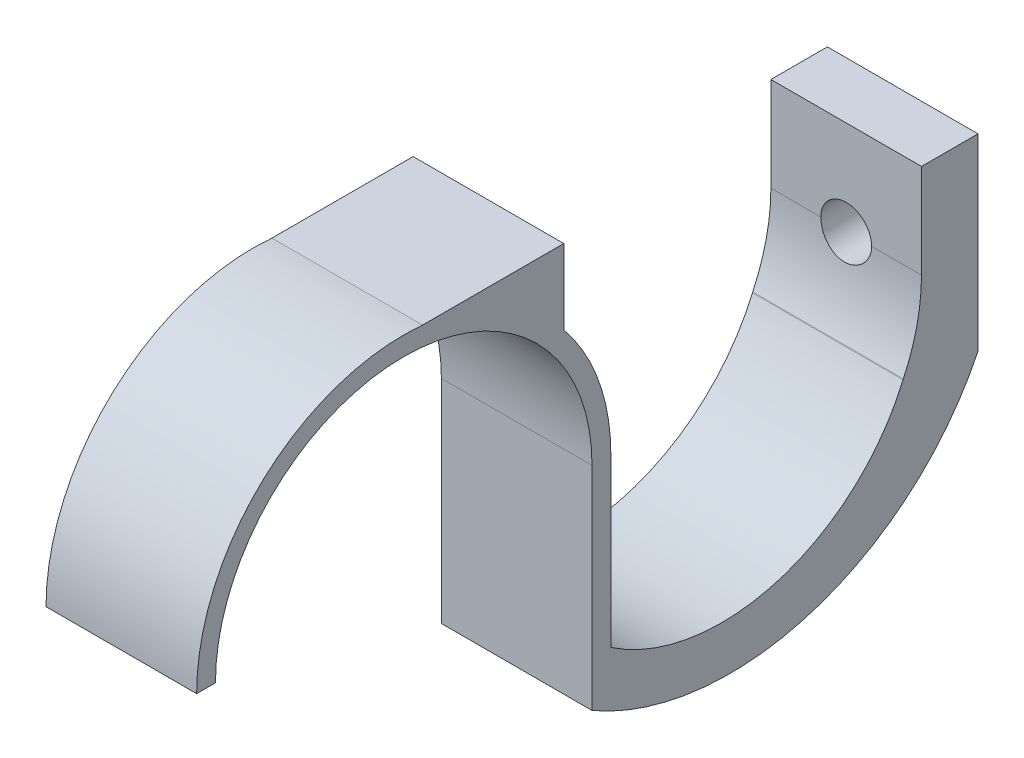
ISO-10303-21;
HEADER;
FILE_DESCRIPTION(('STEP AP214'),'2;1');
FILE_NAME('part.step','',(''),(''),'','','');
FILE_SCHEMA(('AUTOMOTIVE_DESIGN { 1 0 10303 214 1 1 1 1 }'));
ENDSEC;
DATA;
#1=APPLICATION_CONTEXT('core data for automotive mechanical design processes');
#2=APPLICATION_PROTOCOL_DEFINITION('international standard','automotive_design',2000,#1);
#3=PRODUCT_CONTEXT('',#1,'mechanical');
#4=PRODUCT('Part','Part','',(#3));
#5=PRODUCT_RELATED_PRODUCT_CATEGORY('part','',(#4));
#6=PRODUCT_DEFINITION_FORMATION('','',#4);
#7=PRODUCT_DEFINITION_CONTEXT('part definition',#1,'design');
#8=PRODUCT_DEFINITION('design','',#6,#7);
#9=PRODUCT_DEFINITION_SHAPE('','',#8);
#10=(LENGTH_UNIT() NAMED_UNIT(*) SI_UNIT(.MILLI.,.METRE.));
#11=(NAMED_UNIT(*) PLANE_ANGLE_UNIT() SI_UNIT($,.RADIAN.));
#12=(NAMED_UNIT(*) SI_UNIT($,.STERADIAN.) SOLID_ANGLE_UNIT());
#13=UNCERTAINTY_MEASURE_WITH_UNIT(LENGTH_MEASURE(1.E-05),#10,'distance_accuracy_value','');
#14=(GEOMETRIC_REPRESENTATION_CONTEXT(3) GLOBAL_UNCERTAINTY_ASSIGNED_CONTEXT((#13)) GLOBAL_UNIT_ASSIGNED_CONTEXT((#10,
#11,#12)) REPRESENTATION_CONTEXT('',''));
#15=CARTESIAN_POINT('',(0.,0.,0.));
#16=DIRECTION('',(0.,0.,1.));
#17=DIRECTION('',(1.,0.,0.));
#18=AXIS2_PLACEMENT_3D('',#15,#16,#17);
#19=CARTESIAN_POINT('',(10.16,0.,0.));
#20=DIRECTION('',(1.,0.,0.));
#21=DIRECTION('',(0.,0.,-1.));
#22=AXIS2_PLACEMENT_3D('',#19,#20,#21);
#23=PLANE('',#22);
#24=DIRECTION('',(0.,1.,0.));
#25=VECTOR('',#24,1.);
#26=CARTESIAN_POINT('',(10.16,6.35,-19.05));
#27=LINE('',#26,#25);
#28=CARTESIAN_POINT('',(10.16,0.,-19.05));
#29=VERTEX_POINT('',#28);
#30=CARTESIAN_POINT('',(10.16,6.35,-19.05));
#31=VERTEX_POINT('',#30);
#32=EDGE_CURVE('E207',#29,#31,#27,.T.);
#33=ORIENTED_EDGE('',*,*,#32,.F.);
#34=CARTESIAN_POINT('',(10.16,0.,-6.35));
#35=DIRECTION('',(1.,0.,0.));
#36=DIRECTION('',(0.,0.,-1.));
#37=AXIS2_PLACEMENT_3D('',#34,#35,#36);
#38=CIRCLE('',#37,12.7);
#39=CARTESIAN_POINT('',(10.16,-5.44285714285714,-17.8245503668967));
#40=VERTEX_POINT('',#39);
#41=EDGE_CURVE('E239',#40,#29,#38,.T.);
#42=ORIENTED_EDGE('',*,*,#41,.F.);
#43=CARTESIAN_POINT('',(10.16,-5.715,-18.3982778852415));
#44=DIRECTION('',(1.,0.,0.));
#45=DIRECTION('',(0.,0.,-1.));
#46=AXIS2_PLACEMENT_3D('',#43,#44,#45);
#47=CIRCLE('',#46,0.635);
#48=CARTESIAN_POINT('',(10.16,-5.49031696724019,-17.8043565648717));
#49=VERTEX_POINT('',#48);
#50=EDGE_CURVE('E100',#40,#49,#47,.T.);
#51=ORIENTED_EDGE('',*,*,#50,.T.);
#52=CARTESIAN_POINT('',(10.16,-0.255411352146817,-5.56705778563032));
#53=DIRECTION('',(1.,0.,0.));
#54=DIRECTION('',(0.,0.,-1.));
#55=AXIS2_PLACEMENT_3D('',#52,#53,#54);
#56=CIRCLE('',#55,13.3099856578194);
#57=CARTESIAN_POINT('',(10.16,-11.2701319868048,1.905));
#58=VERTEX_POINT('',#57);
#59=EDGE_CURVE('E114',#49,#58,#56,.F.);
#60=ORIENTED_EDGE('',*,*,#59,.T.);
#61=DIRECTION('',(0.,1.,0.));
#62=VECTOR('',#61,1.);
#63=CARTESIAN_POINT('',(10.16,0.,1.905));
#64=LINE('',#63,#62);
#65=CARTESIAN_POINT('',(10.16,0.,1.905));
#66=VERTEX_POINT('',#65);
#67=EDGE_CURVE('E264',#58,#66,#64,.T.);
#68=ORIENTED_EDGE('',*,*,#67,.T.);
#69=CARTESIAN_POINT('',(10.16,0.,15.875));
#70=DIRECTION('',(1.,0.,0.));
#71=DIRECTION('',(0.,0.,-1.));
#72=AXIS2_PLACEMENT_3D('',#69,#70,#71);
#73=CIRCLE('',#72,13.97);
#74=CARTESIAN_POINT('',(10.16,8.86729242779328,5.08));
#75=VERTEX_POINT('',#74);
#76=EDGE_CURVE('E459',#66,#75,#73,.T.);
#77=ORIENTED_EDGE('',*,*,#76,.T.);
#78=DIRECTION('',(0.,-1.,0.));
#79=VECTOR('',#78,1.);
#80=CARTESIAN_POINT('',(10.16,0.,5.07999999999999));
#81=LINE('',#80,#79);
#82=CARTESIAN_POINT('',(10.16,13.9121529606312,5.08));
#83=VERTEX_POINT('',#82);
#84=EDGE_CURVE('E492',#83,#75,#81,.T.);
#85=ORIENTED_EDGE('',*,*,#84,.F.);
#86=DIRECTION('',(0.,0.,-1.));
#87=VECTOR('',#86,1.);
#88=CARTESIAN_POINT('',(10.16,13.9121529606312,0.));
#89=LINE('',#88,#87);
#90=CARTESIAN_POINT('',(10.16,13.9121529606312,14.605));
#91=VERTEX_POINT('',#90);
#92=EDGE_CURVE('E502',#91,#83,#89,.T.);
#93=ORIENTED_EDGE('',*,*,#92,.F.);
#94=CARTESIAN_POINT('',(10.16,0.,15.875));
#95=DIRECTION('',(1.,0.,0.));
#96=DIRECTION('',(0.,0.,-1.));
#97=AXIS2_PLACEMENT_3D('',#94,#95,#96);
#98=CIRCLE('',#97,13.97);
#99=CARTESIAN_POINT('',(10.16,0.,29.845));
#100=VERTEX_POINT('',#99);
#101=EDGE_CURVE('E265',#91,#100,#98,.T.);
#102=ORIENTED_EDGE('',*,*,#101,.T.);
#103=DIRECTION('',(0.,0.,1.));
#104=VECTOR('',#103,1.);
#105=CARTESIAN_POINT('',(10.16,0.,0.));
#106=LINE('',#105,#104);
#107=CARTESIAN_POINT('',(10.16,0.,28.575));
#108=VERTEX_POINT('',#107);
#109=EDGE_CURVE('E479',#108,#100,#106,.T.);
#110=ORIENTED_EDGE('',*,*,#109,.F.);
#111=CARTESIAN_POINT('',(10.16,0.,15.875));
#112=DIRECTION('',(1.,0.,0.));
#113=DIRECTION('',(0.,0.,-1.));
#114=AXIS2_PLACEMENT_3D('',#111,#112,#113);
#115=CIRCLE('',#114,12.7);
#116=CARTESIAN_POINT('',(10.16,0.,3.175));
#117=VERTEX_POINT('',#116);
#118=EDGE_CURVE('E482',#117,#108,#115,.T.);
#119=ORIENTED_EDGE('',*,*,#118,.F.);
#120=DIRECTION('',(0.,1.,0.));
#121=VECTOR('',#120,1.);
#122=CARTESIAN_POINT('',(10.16,0.,3.175));
#123=LINE('',#122,#121);
#124=CARTESIAN_POINT('',(10.16,-14.3181319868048,3.175));
#125=VERTEX_POINT('',#124);
#126=EDGE_CURVE('E485',#125,#117,#123,.T.);
#127=ORIENTED_EDGE('',*,*,#126,.F.);
#128=CARTESIAN_POINT('',(10.16,1.77774673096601,-6.1356237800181));
#129=DIRECTION('',(1.,0.,0.));
#130=DIRECTION('',(0.,0.,-1.));
#131=AXIS2_PLACEMENT_3D('',#128,#129,#130);
#132=CIRCLE('',#131,18.5947580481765);
#133=CARTESIAN_POINT('',(10.16,-6.35,-22.86));
#134=VERTEX_POINT('',#133);
#135=EDGE_CURVE('E261',#134,#125,#132,.F.);
#136=ORIENTED_EDGE('',*,*,#135,.F.);
#137=DIRECTION('',(0.,1.,0.));
#138=VECTOR('',#137,1.);
#139=CARTESIAN_POINT('',(10.16,-6.35,-22.86));
#140=LINE('',#139,#138);
#141=CARTESIAN_POINT('',(10.16,6.35,-22.86));
#142=VERTEX_POINT('',#141);
#143=EDGE_CURVE('E245',#134,#142,#140,.T.);
#144=ORIENTED_EDGE('',*,*,#143,.T.);
#145=DIRECTION('',(0.,0.,-1.));
#146=VECTOR('',#145,1.);
#147=CARTESIAN_POINT('',(10.16,6.35,500000.));
#148=LINE('',#147,#146);
#149=EDGE_CURVE('E227',#31,#142,#148,.T.);
#150=ORIENTED_EDGE('',*,*,#149,.F.);
#151=EDGE_LOOP('',(#33,#42,#51,#60,#68,#77,#85,#93,#102,#110,#119,#127,#136,#144,#150));
#152=FACE_BOUND('',#151,.T.);
#153=ADVANCED_FACE('F92',(#152),#23,.T.);
#154=CARTESIAN_POINT('',(0.,0.,0.));
#155=DIRECTION('',(1.,0.,0.));
#156=DIRECTION('',(0.,0.,-1.));
#157=AXIS2_PLACEMENT_3D('',#154,#155,#156);
#158=PLANE('',#157);
#159=CARTESIAN_POINT('',(0.,0.,-6.35));
#160=DIRECTION('',(1.,0.,0.));
#161=DIRECTION('',(0.,0.,-1.));
#162=AXIS2_PLACEMENT_3D('',#159,#160,#161);
#163=CIRCLE('',#162,12.7);
#164=CARTESIAN_POINT('',(0.,-5.44285714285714,-17.8245503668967));
#165=VERTEX_POINT('',#164);
#166=CARTESIAN_POINT('',(0.,0.,-19.05));
#167=VERTEX_POINT('',#166);
#168=EDGE_CURVE('E220',#165,#167,#163,.T.);
#169=ORIENTED_EDGE('',*,*,#168,.T.);
#170=DIRECTION('',(0.,1.,0.));
#171=VECTOR('',#170,1.);
#172=CARTESIAN_POINT('',(0.,6.35,-19.05));
#173=LINE('',#172,#171);
#174=CARTESIAN_POINT('',(0.,6.35,-19.05));
#175=VERTEX_POINT('',#174);
#176=EDGE_CURVE('E205',#167,#175,#173,.T.);
#177=ORIENTED_EDGE('',*,*,#176,.T.);
#178=DIRECTION('',(0.,0.,-1.));
#179=VECTOR('',#178,1.);
#180=CARTESIAN_POINT('',(0.,6.35,500000.));
#181=LINE('',#180,#179);
#182=CARTESIAN_POINT('',(0.,6.35,-22.86));
#183=VERTEX_POINT('',#182);
#184=EDGE_CURVE('E217',#175,#183,#181,.T.);
#185=ORIENTED_EDGE('',*,*,#184,.T.);
#186=DIRECTION('',(0.,-1.,0.));
#187=VECTOR('',#186,1.);
#188=CARTESIAN_POINT('',(0.,-6.35,-22.86));
#189=LINE('',#188,#187);
#190=CARTESIAN_POINT('',(0.,-6.35,-22.86));
#191=VERTEX_POINT('',#190);
#192=EDGE_CURVE('E230',#183,#191,#189,.T.);
#193=ORIENTED_EDGE('',*,*,#192,.T.);
#194=CARTESIAN_POINT('',(0.,1.77774673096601,-6.1356237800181));
#195=DIRECTION('',(1.,0.,0.));
#196=DIRECTION('',(0.,0.,-1.));
#197=AXIS2_PLACEMENT_3D('',#194,#195,#196);
#198=CIRCLE('',#197,18.5947580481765);
#199=CARTESIAN_POINT('',(0.,-14.3181319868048,3.175));
#200=VERTEX_POINT('',#199);
#201=EDGE_CURVE('E523',#191,#200,#198,.F.);
#202=ORIENTED_EDGE('',*,*,#201,.T.);
#203=DIRECTION('',(0.,1.,0.));
#204=VECTOR('',#203,1.);
#205=CARTESIAN_POINT('',(0.,0.,3.175));
#206=LINE('',#205,#204);
#207=CARTESIAN_POINT('',(0.,0.,3.175));
#208=VERTEX_POINT('',#207);
#209=EDGE_CURVE('E519',#200,#208,#206,.T.);
#210=ORIENTED_EDGE('',*,*,#209,.T.);
#211=CARTESIAN_POINT('',(0.,0.,15.875));
#212=DIRECTION('',(1.,0.,0.));
#213=DIRECTION('',(0.,0.,-1.));
#214=AXIS2_PLACEMENT_3D('',#211,#212,#213);
#215=CIRCLE('',#214,12.7);
#216=CARTESIAN_POINT('',(0.,0.,28.575));
#217=VERTEX_POINT('',#216);
#218=EDGE_CURVE('E498',#208,#217,#215,.T.);
#219=ORIENTED_EDGE('',*,*,#218,.T.);
#220=DIRECTION('',(0.,0.,1.));
#221=VECTOR('',#220,1.);
#222=CARTESIAN_POINT('',(0.,0.,0.));
#223=LINE('',#222,#221);
#224=CARTESIAN_POINT('',(0.,0.,29.845));
#225=VERTEX_POINT('',#224);
#226=EDGE_CURVE('E494',#217,#225,#223,.T.);
#227=ORIENTED_EDGE('',*,*,#226,.T.);
#228=CARTESIAN_POINT('',(0.,0.,15.875));
#229=DIRECTION('',(1.,0.,0.));
#230=DIRECTION('',(0.,0.,-1.));
#231=AXIS2_PLACEMENT_3D('',#228,#229,#230);
#232=CIRCLE('',#231,13.97);
#233=CARTESIAN_POINT('',(0.,13.9121529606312,14.605));
#234=VERTEX_POINT('',#233);
#235=EDGE_CURVE('E476',#234,#225,#232,.T.);
#236=ORIENTED_EDGE('',*,*,#235,.F.);
#237=DIRECTION('',(0.,0.,-1.));
#238=VECTOR('',#237,1.);
#239=CARTESIAN_POINT('',(0.,13.9121529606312,0.));
#240=LINE('',#239,#238);
#241=CARTESIAN_POINT('',(0.,13.9121529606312,5.08));
#242=VERTEX_POINT('',#241);
#243=EDGE_CURVE('E466',#234,#242,#240,.T.);
#244=ORIENTED_EDGE('',*,*,#243,.T.);
#245=DIRECTION('',(0.,-1.,0.));
#246=VECTOR('',#245,1.);
#247=CARTESIAN_POINT('',(0.,0.,5.07999999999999));
#248=LINE('',#247,#246);
#249=CARTESIAN_POINT('',(0.,8.86729242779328,5.08));
#250=VERTEX_POINT('',#249);
#251=EDGE_CURVE('E469',#242,#250,#248,.T.);
#252=ORIENTED_EDGE('',*,*,#251,.T.);
#253=CARTESIAN_POINT('',(0.,0.,1.905));
#254=VERTEX_POINT('',#253);
#255=EDGE_CURVE('E491',#254,#250,#232,.T.);
#256=ORIENTED_EDGE('',*,*,#255,.F.);
#257=DIRECTION('',(0.,1.,0.));
#258=VECTOR('',#257,1.);
#259=CARTESIAN_POINT('',(0.,0.,1.905));
#260=LINE('',#259,#258);
#261=CARTESIAN_POINT('',(0.,-11.2701319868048,1.905));
#262=VERTEX_POINT('',#261);
#263=EDGE_CURVE('E262',#262,#254,#260,.T.);
#264=ORIENTED_EDGE('',*,*,#263,.F.);
#265=CARTESIAN_POINT('',(0.,-0.255411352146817,-5.56705778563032));
#266=DIRECTION('',(1.,0.,0.));
#267=DIRECTION('',(0.,0.,-1.));
#268=AXIS2_PLACEMENT_3D('',#265,#266,#267);
#269=CIRCLE('',#268,13.3099856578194);
#270=CARTESIAN_POINT('',(0.,-5.49031696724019,-17.8043565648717));
#271=VERTEX_POINT('',#270);
#272=EDGE_CURVE('E259',#271,#262,#269,.F.);
#273=ORIENTED_EDGE('',*,*,#272,.F.);
#274=CARTESIAN_POINT('',(0.,-5.715,-18.3982778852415));
#275=DIRECTION('',(1.,0.,0.));
#276=DIRECTION('',(0.,0.,-1.));
#277=AXIS2_PLACEMENT_3D('',#274,#275,#276);
#278=CIRCLE('',#277,0.635);
#279=EDGE_CURVE('E246',#271,#165,#278,.F.);
#280=ORIENTED_EDGE('',*,*,#279,.T.);
#281=EDGE_LOOP('',(#169,#177,#185,#193,#202,#210,#219,#227,#236,#244,#252,#256,#264,#273,#280));
#282=FACE_BOUND('',#281,.T.);
#283=ADVANCED_FACE('F215',(#282),#158,.F.);
#284=CARTESIAN_POINT('',(0.,0.,-6.35));
#285=DIRECTION('',(1.,0.,0.));
#286=DIRECTION('',(0.,0.,-1.));
#287=AXIS2_PLACEMENT_3D('',#284,#285,#286);
#288=CYLINDRICAL_SURFACE('',#287,12.7);
#289=ORIENTED_EDGE('',*,*,#41,.T.);
#290=DIRECTION('',(1.,0.,0.));
#291=VECTOR('',#290,1.);
#292=CARTESIAN_POINT('',(0.,0.,-19.05));
#293=LINE('',#292,#291);
#294=CARTESIAN_POINT('',(6.7945,0.,-19.05));
#295=VERTEX_POINT('',#294);
#296=EDGE_CURVE('E211',#295,#29,#293,.T.);
#297=ORIENTED_EDGE('',*,*,#296,.F.);
#298=CARTESIAN_POINT('',(3.3655,0.,-19.05));
#299=CARTESIAN_POINT('',(3.36550402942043,-0.0958367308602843,-19.0499985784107));
#300=CARTESIAN_POINT('',(3.37356269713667,-0.191731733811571,-19.0489037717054));
#301=CARTESIAN_POINT('',(3.40558051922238,-0.380848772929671,-19.0446416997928));
#302=CARTESIAN_POINT('',(3.42955585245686,-0.474067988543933,-19.0414723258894));
#303=CARTESIAN_POINT('',(3.49268386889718,-0.65506857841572,-19.0334178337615));
#304=CARTESIAN_POINT('',(3.53182585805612,-0.742853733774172,-19.0285339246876));
#305=CARTESIAN_POINT('',(3.62415161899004,-0.910594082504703,-19.0175922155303));
#306=CARTESIAN_POINT('',(3.67733315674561,-0.99055051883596,-19.0115346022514));
#307=CARTESIAN_POINT('',(3.79659067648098,-1.14088939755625,-18.9988775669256));
#308=CARTESIAN_POINT('',(3.86273843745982,-1.21121466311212,-18.9922752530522));
#309=CARTESIAN_POINT('',(4.00589641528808,-1.33980214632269,-18.9792959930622));
#310=CARTESIAN_POINT('',(4.08290721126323,-1.39806372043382,-18.9729190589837));
#311=CARTESIAN_POINT('',(4.24598178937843,-1.50108678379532,-18.9610843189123));
#312=CARTESIAN_POINT('',(4.33208014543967,-1.54579401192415,-18.95563024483));
#313=CARTESIAN_POINT('',(4.51064907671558,-1.62009270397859,-18.9462974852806));
#314=CARTESIAN_POINT('',(4.6031193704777,-1.64968483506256,-18.9424187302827));
#315=CARTESIAN_POINT('',(4.79121057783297,-1.6927380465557,-18.9367037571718));
#316=CARTESIAN_POINT('',(4.88680888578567,-1.70629622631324,-18.9348552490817));
#317=CARTESIAN_POINT('',(5.07894036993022,-1.7171972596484,-18.9333725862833));
#318=CARTESIAN_POINT('',(5.17547350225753,-1.71454087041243,-18.9337383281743));
#319=CARTESIAN_POINT('',(5.36605424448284,-1.69316774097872,-18.9366315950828));
#320=CARTESIAN_POINT('',(5.4601141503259,-1.67455840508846,-18.9391446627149));
#321=CARTESIAN_POINT('',(5.64376388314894,-1.62197541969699,-18.946026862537));
#322=CARTESIAN_POINT('',(5.73335360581,-1.58800141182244,-18.9503960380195));
#323=CARTESIAN_POINT('',(5.90585090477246,-1.50553945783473,-18.9605143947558));
#324=CARTESIAN_POINT('',(5.9887361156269,-1.45700528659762,-18.966267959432));
#325=CARTESIAN_POINT('',(6.14522634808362,-1.34683372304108,-18.9785035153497));
#326=CARTESIAN_POINT('',(6.21883087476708,-1.2851956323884,-18.9849855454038));
#327=CARTESIAN_POINT('',(6.35529343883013,-1.14997281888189,-18.9980117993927));
#328=CARTESIAN_POINT('',(6.41805985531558,-1.07629560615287,-19.0045561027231));
#329=CARTESIAN_POINT('',(6.53034959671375,-0.91940320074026,-19.0169206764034));
#330=CARTESIAN_POINT('',(6.57987288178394,-0.836187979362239,-19.0227409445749));
#331=CARTESIAN_POINT('',(6.66427239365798,-0.662507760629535,-19.0330061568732));
#332=CARTESIAN_POINT('',(6.69914237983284,-0.572039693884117,-19.0374505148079));
#333=CARTESIAN_POINT('',(6.75317012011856,-0.386458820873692,-19.0444580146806));
#334=CARTESIAN_POINT('',(6.77232873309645,-0.291346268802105,-19.0470212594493));
#335=CARTESIAN_POINT('',(6.79426997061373,-0.0999679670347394,-19.049964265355));
#336=CARTESIAN_POINT('',(6.79717871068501,-0.00371692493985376,-19.0503608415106));
#337=CARTESIAN_POINT('',(6.78687118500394,0.187899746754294,-19.0489713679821));
#338=CARTESIAN_POINT('',(6.77365532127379,0.283265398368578,-19.0471853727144));
#339=CARTESIAN_POINT('',(6.73157855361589,0.47002833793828,-19.0416418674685));
#340=CARTESIAN_POINT('',(6.70277828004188,0.561439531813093,-19.0378919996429));
#341=CARTESIAN_POINT('',(6.63041360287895,0.738135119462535,-19.0288402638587));
#342=CARTESIAN_POINT('',(6.58684862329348,0.823419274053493,-19.0235383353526));
#343=CARTESIAN_POINT('',(6.48588956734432,0.985999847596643,-19.0119309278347));
#344=CARTESIAN_POINT('',(6.42841450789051,1.06324555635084,-19.005619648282));
#345=CARTESIAN_POINT('',(6.30138067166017,1.20703938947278,-18.9927163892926));
#346=CARTESIAN_POINT('',(6.23182133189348,1.27358701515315,-18.9861243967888));
#347=CARTESIAN_POINT('',(6.08203564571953,1.39454744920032,-18.9733502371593));
#348=CARTESIAN_POINT('',(6.00174119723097,1.44887629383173,-18.9671710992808));
#349=CARTESIAN_POINT('',(5.8330925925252,1.54327557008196,-18.95597357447));
#350=CARTESIAN_POINT('',(5.74473862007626,1.58334632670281,-18.9509551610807));
#351=CARTESIAN_POINT('',(5.56274212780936,1.64795821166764,-18.9426684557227));
#352=CARTESIAN_POINT('',(5.46911623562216,1.67254548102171,-18.9393949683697));
#353=CARTESIAN_POINT('',(5.27901722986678,1.70564042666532,-18.9349542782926));
#354=CARTESIAN_POINT('',(5.18254427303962,1.71414898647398,-18.9337869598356));
#355=CARTESIAN_POINT('',(4.99032551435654,1.71482694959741,-18.9336945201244));
#356=CARTESIAN_POINT('',(4.89458016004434,1.70712829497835,-18.9347512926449));
#357=CARTESIAN_POINT('',(4.70575813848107,1.67589103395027,-18.9389488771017));
#358=CARTESIAN_POINT('',(4.6126814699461,1.65235243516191,-18.9420896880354));
#359=CARTESIAN_POINT('',(4.43186361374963,1.5901468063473,-18.9500955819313));
#360=CARTESIAN_POINT('',(4.34411982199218,1.55148722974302,-18.9549598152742));
#361=CARTESIAN_POINT('',(4.17634302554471,1.46015002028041,-18.9658657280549));
#362=CARTESIAN_POINT('',(4.09631018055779,1.40747209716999,-18.9719074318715));
#363=CARTESIAN_POINT('',(3.94555407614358,1.28910768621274,-18.9845463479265));
#364=CARTESIAN_POINT('',(3.8749081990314,1.22332305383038,-18.9911475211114));
#365=CARTESIAN_POINT('',(3.74560947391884,1.08081897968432,-19.0041273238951));
#366=CARTESIAN_POINT('',(3.6869594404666,1.00409697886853,-19.0105059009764));
#367=CARTESIAN_POINT('',(3.58309124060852,0.84150160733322,-19.0223535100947));
#368=CARTESIAN_POINT('',(3.53793371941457,0.755589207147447,-19.0278183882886));
#369=CARTESIAN_POINT('',(3.46275350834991,0.577371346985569,-19.0371814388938));
#370=CARTESIAN_POINT('',(3.4327146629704,0.48507283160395,-19.0410812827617));
#371=CARTESIAN_POINT('',(3.39567366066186,0.326933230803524,-19.0459535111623));
#372=CARTESIAN_POINT('',(3.38437518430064,0.262081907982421,-19.0474634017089));
#373=CARTESIAN_POINT('',(3.36928700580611,0.131496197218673,-19.0494871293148));
#374=CARTESIAN_POINT('',(3.36549723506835,0.0657618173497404,-19.0500009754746));
#375=CARTESIAN_POINT('',(3.3655,0.,-19.05));
#376=B_SPLINE_CURVE_WITH_KNOTS('',3,(#298,#299,#300,#301,#302,#303,#304,#305,#306,#307,#308,
#309,#310,#311,#312,#313,#314,#315,#316,#317,#318,#319,#320,#321,#322,#323,#324,#325,#326,#327,
#328,#329,#330,#331,#332,#333,#334,#335,#336,#337,#338,#339,#340,#341,#342,#343,#344,#345,#346,
#347,#348,#349,#350,#351,#352,#353,#354,#355,#356,#357,#358,#359,#360,#361,#362,#363,#364,#365,
#366,#367,#368,#369,#370,#371,#372,#373,#374,#375),.UNSPECIFIED.,.T.,.F.,(4,2,2,2,2,2,2,2,2,2,2,
2,2,2,2,2,2,2,2,2,2,2,2,2,2,2,2,2,2,2,2,2,2,2,2,2,2,2,4),(0.,0.287269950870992,
0.574832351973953,0.862192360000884,1.14950666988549,1.43845887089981,1.72742648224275,
2.01753606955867,2.30763285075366,2.59596370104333,2.88428108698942,3.1706724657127,
3.4570705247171,3.74438763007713,4.03172005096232,4.32137372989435,4.61102828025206,
4.90080606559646,5.1905680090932,5.4780779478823,5.76558071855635,6.05197293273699,
6.33837632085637,6.62648902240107,6.91461515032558,7.20466449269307,7.49470722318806,
7.78388148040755,8.07303984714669,8.35985329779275,8.64666661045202,8.93333872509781,
9.22001677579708,9.50892815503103,9.79790724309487,10.0881663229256,10.3781145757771,
10.5752369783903,10.7723575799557),.UNSPECIFIED.);
#377=CARTESIAN_POINT('',(3.3655,0.,-19.05));
#378=VERTEX_POINT('',#377);
#379=EDGE_CURVE('E232',#378,#295,#376,.T.);
#380=ORIENTED_EDGE('',*,*,#379,.F.);
#381=EDGE_CURVE('E107',#167,#378,#293,.T.);
#382=ORIENTED_EDGE('',*,*,#381,.F.);
#383=ORIENTED_EDGE('',*,*,#168,.F.);
#384=DIRECTION('',(1.,0.,0.));
#385=VECTOR('',#384,1.);
#386=CARTESIAN_POINT('',(0.,-5.44285714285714,-17.8245503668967));
#387=LINE('',#386,#385);
#388=EDGE_CURVE('E238',#165,#40,#387,.T.);
#389=ORIENTED_EDGE('',*,*,#388,.T.);
#390=EDGE_LOOP('',(#289,#297,#380,#382,#383,#389));
#391=FACE_BOUND('',#390,.T.);
#392=ADVANCED_FACE('F324',(#391),#288,.F.);
#393=CARTESIAN_POINT('',(0.,-5.715,-18.3982778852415));
#394=DIRECTION('',(1.,0.,0.));
#395=DIRECTION('',(0.,0.,-1.));
#396=AXIS2_PLACEMENT_3D('',#393,#394,#395);
#397=CYLINDRICAL_SURFACE('',#396,0.635);
#398=ORIENTED_EDGE('',*,*,#279,.F.);
#399=DIRECTION('',(-1.,0.,0.));
#400=VECTOR('',#399,1.);
#401=CARTESIAN_POINT('',(5.08000000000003,-5.49031696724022,-17.8043565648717));
#402=LINE('',#401,#400);
#403=EDGE_CURVE('E242',#271,#49,#402,.F.);
#404=ORIENTED_EDGE('',*,*,#403,.T.);
#405=ORIENTED_EDGE('',*,*,#50,.F.);
#406=ORIENTED_EDGE('',*,*,#388,.F.);
#407=EDGE_LOOP('',(#398,#404,#405,#406));
#408=FACE_BOUND('',#407,.T.);
#409=ADVANCED_FACE('F94',(#408),#397,.T.);
#410=CARTESIAN_POINT('',(10.16,6.35,500000.));
#411=DIRECTION('',(0.,-1.,0.));
#412=DIRECTION('',(1.,0.,0.));
#413=AXIS2_PLACEMENT_3D('',#410,#411,#412);
#414=PLANE('',#413);
#415=ORIENTED_EDGE('',*,*,#184,.F.);
#416=DIRECTION('',(1.,0.,0.));
#417=VECTOR('',#416,1.);
#418=CARTESIAN_POINT('',(0.,6.35,-19.05));
#419=LINE('',#418,#417);
#420=EDGE_CURVE('E202',#175,#31,#419,.T.);
#421=ORIENTED_EDGE('',*,*,#420,.T.);
#422=ORIENTED_EDGE('',*,*,#149,.T.);
#423=DIRECTION('',(-1.,0.,0.));
#424=VECTOR('',#423,1.);
#425=CARTESIAN_POINT('',(10.16,6.35,-22.86));
#426=LINE('',#425,#424);
#427=EDGE_CURVE('E224',#142,#183,#426,.T.);
#428=ORIENTED_EDGE('',*,*,#427,.T.);
#429=EDGE_LOOP('',(#415,#421,#422,#428));
#430=FACE_BOUND('',#429,.T.);
#431=ADVANCED_FACE('F222',(#430),#414,.F.);
#432=CARTESIAN_POINT('',(0.,0.,-22.86));
#433=DIRECTION('',(0.,0.,1.));
#434=DIRECTION('',(1.,0.,0.));
#435=AXIS2_PLACEMENT_3D('',#432,#433,#434);
#436=PLANE('',#435);
#437=CARTESIAN_POINT('',(5.08,0.,-22.86));
#438=DIRECTION('',(0.,0.,-1.));
#439=DIRECTION('',(-1.,0.,0.));
#440=AXIS2_PLACEMENT_3D('',#437,#438,#439);
#441=CIRCLE('',#440,1.7145);
#442=CARTESIAN_POINT('',(3.3655,0.,-22.86));
#443=VERTEX_POINT('',#442);
#444=EDGE_CURVE('E266',#443,#443,#441,.T.);
#445=ORIENTED_EDGE('',*,*,#444,.F.);
#446=EDGE_LOOP('',(#445));
#447=FACE_BOUND('',#446,.T.);
#448=ORIENTED_EDGE('',*,*,#143,.F.);
#449=DIRECTION('',(1.,0.,0.));
#450=VECTOR('',#449,1.);
#451=CARTESIAN_POINT('',(10.16,-6.35,-22.86));
#452=LINE('',#451,#450);
#453=EDGE_CURVE('E226',#191,#134,#452,.T.);
#454=ORIENTED_EDGE('',*,*,#453,.F.);
#455=ORIENTED_EDGE('',*,*,#192,.F.);
#456=ORIENTED_EDGE('',*,*,#427,.F.);
#457=EDGE_LOOP('',(#448,#454,#455,#456));
#458=FACE_BOUND('',#457,.T.);
#459=ADVANCED_FACE('F330',(#447,#458),#436,.F.);
#460=CARTESIAN_POINT('',(5.08,0.,20.321));
#461=DIRECTION('',(0.,0.,-1.));
#462=DIRECTION('',(-1.,0.,0.));
#463=AXIS2_PLACEMENT_3D('',#460,#461,#462);
#464=CYLINDRICAL_SURFACE('',#463,1.7145);
#465=ORIENTED_EDGE('',*,*,#444,.T.);
#466=EDGE_LOOP('',(#465));
#467=FACE_BOUND('',#466,.T.);
#468=ORIENTED_EDGE('',*,*,#379,.T.);
#469=CARTESIAN_POINT('',(5.08,0.,-19.05));
#470=DIRECTION('',(0.,0.,-1.));
#471=DIRECTION('',(-1.,0.,0.));
#472=AXIS2_PLACEMENT_3D('',#469,#470,#471);
#473=CIRCLE('',#472,1.7145);
#474=EDGE_CURVE('E47',#295,#378,#473,.F.);
#475=ORIENTED_EDGE('',*,*,#474,.T.);
#476=EDGE_LOOP('',(#468,#475));
#477=FACE_BOUND('',#476,.T.);
#478=ADVANCED_FACE('F275',(#467,#477),#464,.F.);
#479=CARTESIAN_POINT('',(71.1981609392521,0.,5.07999999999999));
#480=DIRECTION('',(0.,0.,-1.));
#481=DIRECTION('',(0.,1.,0.));
#482=AXIS2_PLACEMENT_3D('',#479,#480,#481);
#483=PLANE('',#482);
#484=DIRECTION('',(-1.,0.,0.));
#485=VECTOR('',#484,1.);
#486=CARTESIAN_POINT('',(71.1981609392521,13.9121529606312,5.08));
#487=LINE('',#486,#485);
#488=EDGE_CURVE('E257',#83,#242,#487,.T.);
#489=ORIENTED_EDGE('',*,*,#488,.F.);
#490=ORIENTED_EDGE('',*,*,#84,.T.);
#491=DIRECTION('',(-1.,0.,0.));
#492=VECTOR('',#491,1.);
#493=CARTESIAN_POINT('',(71.1981609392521,8.86729242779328,5.08));
#494=LINE('',#493,#492);
#495=EDGE_CURVE('E464',#75,#250,#494,.T.);
#496=ORIENTED_EDGE('',*,*,#495,.T.);
#497=ORIENTED_EDGE('',*,*,#251,.F.);
#498=EDGE_LOOP('',(#489,#490,#496,#497));
#499=FACE_BOUND('',#498,.T.);
#500=ADVANCED_FACE('F280',(#499),#483,.T.);
#501=CARTESIAN_POINT('',(71.1981609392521,0.,15.875));
#502=DIRECTION('',(-1.,0.,0.));
#503=DIRECTION('',(0.,0.,1.));
#504=AXIS2_PLACEMENT_3D('',#501,#502,#503);
#505=CYLINDRICAL_SURFACE('',#504,13.97);
#506=ORIENTED_EDGE('',*,*,#76,.F.);
#507=DIRECTION('',(-1.,0.,0.));
#508=VECTOR('',#507,1.);
#509=CARTESIAN_POINT('',(71.1981609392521,0.,1.905));
#510=LINE('',#509,#508);
#511=EDGE_CURVE('E462',#66,#254,#510,.T.);
#512=ORIENTED_EDGE('',*,*,#511,.T.);
#513=ORIENTED_EDGE('',*,*,#255,.T.);
#514=ORIENTED_EDGE('',*,*,#495,.F.);
#515=EDGE_LOOP('',(#506,#512,#513,#514));
#516=FACE_BOUND('',#515,.T.);
#517=ADVANCED_FACE('F283',(#516),#505,.T.);
#518=CARTESIAN_POINT('',(71.1981609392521,0.,1.905));
#519=DIRECTION('',(0.,0.,1.));
#520=DIRECTION('',(1.,0.,0.));
#521=AXIS2_PLACEMENT_3D('',#518,#519,#520);
#522=PLANE('',#521);
#523=ORIENTED_EDGE('',*,*,#67,.F.);
#524=DIRECTION('',(-1.,0.,0.));
#525=VECTOR('',#524,1.);
#526=CARTESIAN_POINT('',(71.1981609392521,-11.2701319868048,1.905));
#527=LINE('',#526,#525);
#528=EDGE_CURVE('E488',#58,#262,#527,.T.);
#529=ORIENTED_EDGE('',*,*,#528,.T.);
#530=ORIENTED_EDGE('',*,*,#263,.T.);
#531=ORIENTED_EDGE('',*,*,#511,.F.);
#532=EDGE_LOOP('',(#523,#529,#530,#531));
#533=FACE_BOUND('',#532,.T.);
#534=ADVANCED_FACE('F285',(#533),#522,.F.);
#535=CARTESIAN_POINT('',(71.1981609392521,-0.255411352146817,-5.56705778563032));
#536=DIRECTION('',(-1.,0.,0.));
#537=DIRECTION('',(0.,0.,1.));
#538=AXIS2_PLACEMENT_3D('',#535,#536,#537);
#539=CYLINDRICAL_SURFACE('',#538,13.3099856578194);
#540=ORIENTED_EDGE('',*,*,#403,.F.);
#541=ORIENTED_EDGE('',*,*,#272,.T.);
#542=ORIENTED_EDGE('',*,*,#528,.F.);
#543=ORIENTED_EDGE('',*,*,#59,.F.);
#544=EDGE_LOOP('',(#540,#541,#542,#543));
#545=FACE_BOUND('',#544,.T.);
#546=ADVANCED_FACE('F288',(#545),#539,.F.);
#547=CARTESIAN_POINT('',(71.1981609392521,1.77774673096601,-6.1356237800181));
#548=DIRECTION('',(-1.,0.,0.));
#549=DIRECTION('',(0.,0.,1.));
#550=AXIS2_PLACEMENT_3D('',#547,#548,#549);
#551=CYLINDRICAL_SURFACE('',#550,18.5947580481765);
#552=ORIENTED_EDGE('',*,*,#453,.T.);
#553=ORIENTED_EDGE('',*,*,#135,.T.);
#554=DIRECTION('',(-1.,0.,0.));
#555=VECTOR('',#554,1.);
#556=CARTESIAN_POINT('',(71.1981609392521,-14.3181319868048,3.175));
#557=LINE('',#556,#555);
#558=EDGE_CURVE('E486',#125,#200,#557,.T.);
#559=ORIENTED_EDGE('',*,*,#558,.T.);
#560=ORIENTED_EDGE('',*,*,#201,.F.);
#561=EDGE_LOOP('',(#552,#553,#559,#560));
#562=FACE_BOUND('',#561,.T.);
#563=ADVANCED_FACE('F292',(#562),#551,.T.);
#564=CARTESIAN_POINT('',(71.1981609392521,0.,3.175));
#565=DIRECTION('',(0.,0.,1.));
#566=DIRECTION('',(0.,-1.,0.));
#567=AXIS2_PLACEMENT_3D('',#564,#565,#566);
#568=PLANE('',#567);
#569=ORIENTED_EDGE('',*,*,#558,.F.);
#570=ORIENTED_EDGE('',*,*,#126,.T.);
#571=DIRECTION('',(-1.,0.,0.));
#572=VECTOR('',#571,1.);
#573=CARTESIAN_POINT('',(71.1981609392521,0.,3.175));
#574=LINE('',#573,#572);
#575=EDGE_CURVE('E483',#117,#208,#574,.T.);
#576=ORIENTED_EDGE('',*,*,#575,.T.);
#577=ORIENTED_EDGE('',*,*,#209,.F.);
#578=EDGE_LOOP('',(#569,#570,#576,#577));
#579=FACE_BOUND('',#578,.T.);
#580=ADVANCED_FACE('F295',(#579),#568,.T.);
#581=CARTESIAN_POINT('',(71.1981609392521,0.,15.875));
#582=DIRECTION('',(-1.,0.,0.));
#583=DIRECTION('',(0.,0.,1.));
#584=AXIS2_PLACEMENT_3D('',#581,#582,#583);
#585=CYLINDRICAL_SURFACE('',#584,12.7);
#586=ORIENTED_EDGE('',*,*,#575,.F.);
#587=ORIENTED_EDGE('',*,*,#118,.T.);
#588=DIRECTION('',(-1.,0.,0.));
#589=VECTOR('',#588,1.);
#590=CARTESIAN_POINT('',(71.1981609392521,0.,28.575));
#591=LINE('',#590,#589);
#592=EDGE_CURVE('E480',#108,#217,#591,.T.);
#593=ORIENTED_EDGE('',*,*,#592,.T.);
#594=ORIENTED_EDGE('',*,*,#218,.F.);
#595=EDGE_LOOP('',(#586,#587,#593,#594));
#596=FACE_BOUND('',#595,.T.);
#597=ADVANCED_FACE('F299',(#596),#585,.F.);
#598=CARTESIAN_POINT('',(71.1981609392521,0.,0.));
#599=DIRECTION('',(0.,-1.,0.));
#600=DIRECTION('',(0.,0.,-1.));
#601=AXIS2_PLACEMENT_3D('',#598,#599,#600);
#602=PLANE('',#601);
#603=ORIENTED_EDGE('',*,*,#592,.F.);
#604=ORIENTED_EDGE('',*,*,#109,.T.);
#605=DIRECTION('',(-1.,0.,0.));
#606=VECTOR('',#605,1.);
#607=CARTESIAN_POINT('',(71.1981609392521,0.,29.845));
#608=LINE('',#607,#606);
#609=EDGE_CURVE('E477',#100,#225,#608,.T.);
#610=ORIENTED_EDGE('',*,*,#609,.T.);
#611=ORIENTED_EDGE('',*,*,#226,.F.);
#612=EDGE_LOOP('',(#603,#604,#610,#611));
#613=FACE_BOUND('',#612,.T.);
#614=ADVANCED_FACE('F303',(#613),#602,.T.);
#615=ORIENTED_EDGE('',*,*,#101,.F.);
#616=DIRECTION('',(-1.,0.,0.));
#617=VECTOR('',#616,1.);
#618=CARTESIAN_POINT('',(71.1981609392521,13.9121529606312,14.605));
#619=LINE('',#618,#617);
#620=EDGE_CURVE('E474',#91,#234,#619,.T.);
#621=ORIENTED_EDGE('',*,*,#620,.T.);
#622=ORIENTED_EDGE('',*,*,#235,.T.);
#623=ORIENTED_EDGE('',*,*,#609,.F.);
#624=EDGE_LOOP('',(#615,#621,#622,#623));
#625=FACE_BOUND('',#624,.T.);
#626=ADVANCED_FACE('F307',(#625),#505,.T.);
#627=CARTESIAN_POINT('',(71.1981609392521,13.9121529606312,0.));
#628=DIRECTION('',(0.,1.,0.));
#629=DIRECTION('',(0.,0.,1.));
#630=AXIS2_PLACEMENT_3D('',#627,#628,#629);
#631=PLANE('',#630);
#632=ORIENTED_EDGE('',*,*,#620,.F.);
#633=ORIENTED_EDGE('',*,*,#92,.T.);
#634=ORIENTED_EDGE('',*,*,#488,.T.);
#635=ORIENTED_EDGE('',*,*,#243,.F.);
#636=EDGE_LOOP('',(#632,#633,#634,#635));
#637=FACE_BOUND('',#636,.T.);
#638=ADVANCED_FACE('F311',(#637),#631,.T.);
#639=CARTESIAN_POINT('',(0.,6.35,-19.05));
#640=DIRECTION('',(0.,0.,-1.));
#641=DIRECTION('',(-1.,0.,0.));
#642=AXIS2_PLACEMENT_3D('',#639,#640,#641);
#643=PLANE('',#642);
#644=ORIENTED_EDGE('',*,*,#296,.T.);
#645=ORIENTED_EDGE('',*,*,#32,.T.);
#646=ORIENTED_EDGE('',*,*,#420,.F.);
#647=ORIENTED_EDGE('',*,*,#176,.F.);
#648=ORIENTED_EDGE('',*,*,#381,.T.);
#649=ORIENTED_EDGE('',*,*,#474,.F.);
#650=EDGE_LOOP('',(#644,#645,#646,#647,#648,#649));
#651=FACE_BOUND('',#650,.T.);
#652=ADVANCED_FACE('F204',(#651),#643,.F.);
#653=CLOSED_SHELL('',(#153,#283,#392,#409,#431,#459,#478,#500,#517,#534,#546,#563,#580,#597,
#614,#626,#638,#652));
#654=MANIFOLD_SOLID_BREP('B7',#653);
#655=ADVANCED_BREP_SHAPE_REPRESENTATION('',(#18,#654),#14);
#656=SHAPE_DEFINITION_REPRESENTATION(#9,#655);
ENDSEC;
END-ISO-10303-21;
